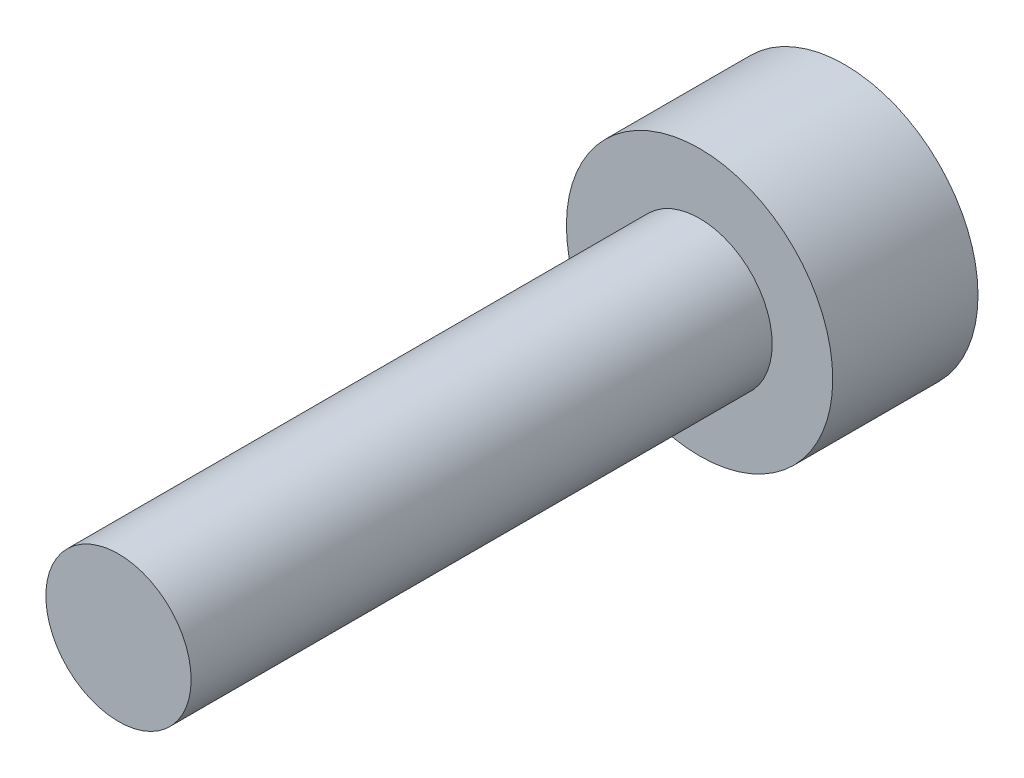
from build123d import *

# Parameters (mm, degrees)
HEX_2_DEPTH = 2.5


with BuildPart() as part:
    # Sketch6 → Revolve1 (revolve)
    with BuildSketch(Plane(origin=(0, 0, 0), x_dir=(0, 0, -1), z_dir=(1, 0, 0)), mode=Mode.PRIVATE) as revolve1_sk:
        Polygon((-12, 0), (-12, -1.5), (0, -1.5), (0, -2.75), (3, -2.75), (3, 0), align=None)
    revolve(revolve1_sk.sketch.rotate(Axis((0, 0, 12), (0, 0, -1)), 270), axis=Axis((0, 0, 12), (0, 0, -1)))

    # Sketch7 → HEX 2 (cut)
    with BuildSketch(Plane(origin=(0, 0, -3), x_dir=(-1, 0, 0), z_dir=(0, 0, -1))):
        Polygon((-1.25, 0.721687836), (-1.25, -0.721687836), (0, -1.443375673), (1.25, -0.721687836), (1.25, 0.721687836), (0, 1.443375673), align=None)
    extrude(amount=-HEX_2_DEPTH, mode=Mode.SUBTRACT)


solid = part.part
